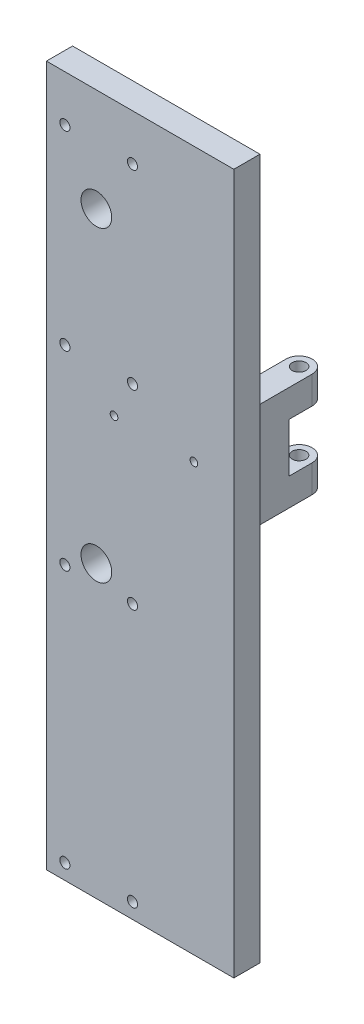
ISO-10303-21;
HEADER;
FILE_DESCRIPTION(('STEP AP214'),'2;1');
FILE_NAME('part.step','',(''),(''),'','','');
FILE_SCHEMA(('AUTOMOTIVE_DESIGN { 1 0 10303 214 1 1 1 1 }'));
ENDSEC;
DATA;
#1=APPLICATION_CONTEXT('core data for automotive mechanical design processes');
#2=APPLICATION_PROTOCOL_DEFINITION('international standard','automotive_design',2000,#1);
#3=PRODUCT_CONTEXT('',#1,'mechanical');
#4=PRODUCT('Part','Part','',(#3));
#5=PRODUCT_RELATED_PRODUCT_CATEGORY('part','',(#4));
#6=PRODUCT_DEFINITION_FORMATION('','',#4);
#7=PRODUCT_DEFINITION_CONTEXT('part definition',#1,'design');
#8=PRODUCT_DEFINITION('design','',#6,#7);
#9=PRODUCT_DEFINITION_SHAPE('','',#8);
#10=(LENGTH_UNIT() NAMED_UNIT(*) SI_UNIT(.MILLI.,.METRE.));
#11=(NAMED_UNIT(*) PLANE_ANGLE_UNIT() SI_UNIT($,.RADIAN.));
#12=(NAMED_UNIT(*) SI_UNIT($,.STERADIAN.) SOLID_ANGLE_UNIT());
#13=UNCERTAINTY_MEASURE_WITH_UNIT(LENGTH_MEASURE(1.E-05),#10,'distance_accuracy_value','');
#14=(GEOMETRIC_REPRESENTATION_CONTEXT(3) GLOBAL_UNCERTAINTY_ASSIGNED_CONTEXT((#13)) GLOBAL_UNIT_ASSIGNED_CONTEXT((#10,
#11,#12)) REPRESENTATION_CONTEXT('',''));
#15=CARTESIAN_POINT('',(0.,0.,0.));
#16=DIRECTION('',(0.,0.,1.));
#17=DIRECTION('',(1.,0.,0.));
#18=AXIS2_PLACEMENT_3D('',#15,#16,#17);
#19=CARTESIAN_POINT('',(0.,68.,0.));
#20=DIRECTION('',(0.,0.,-1.));
#21=DIRECTION('',(-1.,0.,0.));
#22=AXIS2_PLACEMENT_3D('',#19,#20,#21);
#23=PLANE('',#22);
#24=CARTESIAN_POINT('',(32.5000000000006,145.,0.));
#25=DIRECTION('',(0.,0.,-1.));
#26=DIRECTION('',(-1.,0.,0.));
#27=AXIS2_PLACEMENT_3D('',#24,#25,#26);
#28=CIRCLE('',#27,10.);
#29=CARTESIAN_POINT('',(22.5000000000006,145.,0.));
#30=VERTEX_POINT('',#29);
#31=EDGE_CURVE('E626',#30,#30,#28,.T.);
#32=ORIENTED_EDGE('',*,*,#31,.F.);
#33=EDGE_LOOP('',(#32));
#34=FACE_BOUND('',#33,.T.);
#35=CARTESIAN_POINT('',(32.5000000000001,-55.0000000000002,0.));
#36=DIRECTION('',(0.,0.,-1.));
#37=DIRECTION('',(-1.,0.,0.));
#38=AXIS2_PLACEMENT_3D('',#35,#36,#37);
#39=CIRCLE('',#38,10.);
#40=CARTESIAN_POINT('',(22.5000000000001,-55.0000000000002,0.));
#41=VERTEX_POINT('',#40);
#42=EDGE_CURVE('E636',#41,#41,#39,.T.);
#43=ORIENTED_EDGE('',*,*,#42,.F.);
#44=EDGE_LOOP('',(#43));
#45=FACE_BOUND('',#44,.T.);
#46=CARTESIAN_POINT('',(12.,58.,0.));
#47=DIRECTION('',(0.,0.,-1.));
#48=DIRECTION('',(-1.,0.,0.));
#49=AXIS2_PLACEMENT_3D('',#46,#47,#48);
#50=CIRCLE('',#49,3.29999999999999);
#51=CARTESIAN_POINT('',(8.70000000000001,58.,0.));
#52=VERTEX_POINT('',#51);
#53=EDGE_CURVE('E642',#52,#52,#50,.T.);
#54=ORIENTED_EDGE('',*,*,#53,.F.);
#55=EDGE_LOOP('',(#54));
#56=FACE_BOUND('',#55,.T.);
#57=CARTESIAN_POINT('',(56.,58.,0.));
#58=DIRECTION('',(0.,0.,-1.));
#59=DIRECTION('',(-1.,0.,0.));
#60=AXIS2_PLACEMENT_3D('',#57,#58,#59);
#61=CIRCLE('',#60,3.29999999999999);
#62=CARTESIAN_POINT('',(52.7,58.,0.));
#63=VERTEX_POINT('',#62);
#64=EDGE_CURVE('E34',#63,#63,#61,.T.);
#65=ORIENTED_EDGE('',*,*,#64,.F.);
#66=EDGE_LOOP('',(#65));
#67=FACE_BOUND('',#66,.T.);
#68=CARTESIAN_POINT('',(56.,-66.,0.));
#69=DIRECTION('',(0.,0.,-1.));
#70=DIRECTION('',(-1.,0.,0.));
#71=AXIS2_PLACEMENT_3D('',#68,#69,#70);
#72=CIRCLE('',#71,3.29999999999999);
#73=CARTESIAN_POINT('',(52.7,-66.,0.));
#74=VERTEX_POINT('',#73);
#75=EDGE_CURVE('E651',#74,#74,#72,.T.);
#76=ORIENTED_EDGE('',*,*,#75,.F.);
#77=EDGE_LOOP('',(#76));
#78=FACE_BOUND('',#77,.T.);
#79=CARTESIAN_POINT('',(12.,-66.,0.));
#80=DIRECTION('',(0.,0.,-1.));
#81=DIRECTION('',(-1.,0.,0.));
#82=AXIS2_PLACEMENT_3D('',#79,#80,#81);
#83=CIRCLE('',#82,3.29999999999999);
#84=CARTESIAN_POINT('',(8.70000000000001,-66.,0.));
#85=VERTEX_POINT('',#84);
#86=EDGE_CURVE('E657',#85,#85,#83,.T.);
#87=ORIENTED_EDGE('',*,*,#86,.F.);
#88=EDGE_LOOP('',(#87));
#89=FACE_BOUND('',#88,.T.);
#90=CARTESIAN_POINT('',(12.,-234.,0.));
#91=DIRECTION('',(0.,0.,-1.));
#92=DIRECTION('',(-1.,0.,0.));
#93=AXIS2_PLACEMENT_3D('',#90,#91,#92);
#94=CIRCLE('',#93,3.29999999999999);
#95=CARTESIAN_POINT('',(8.70000000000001,-234.,0.));
#96=VERTEX_POINT('',#95);
#97=EDGE_CURVE('E170',#96,#96,#94,.T.);
#98=ORIENTED_EDGE('',*,*,#97,.F.);
#99=EDGE_LOOP('',(#98));
#100=FACE_BOUND('',#99,.T.);
#101=CARTESIAN_POINT('',(56.,-234.,0.));
#102=DIRECTION('',(0.,0.,-1.));
#103=DIRECTION('',(-1.,0.,0.));
#104=AXIS2_PLACEMENT_3D('',#101,#102,#103);
#105=CIRCLE('',#104,3.29999999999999);
#106=CARTESIAN_POINT('',(52.7,-234.,0.));
#107=VERTEX_POINT('',#106);
#108=EDGE_CURVE('E160',#107,#107,#105,.T.);
#109=ORIENTED_EDGE('',*,*,#108,.F.);
#110=EDGE_LOOP('',(#109));
#111=FACE_BOUND('',#110,.T.);
#112=CARTESIAN_POINT('',(12.,182.,0.));
#113=DIRECTION('',(0.,0.,-1.));
#114=DIRECTION('',(-1.,0.,0.));
#115=AXIS2_PLACEMENT_3D('',#112,#113,#114);
#116=CIRCLE('',#115,3.29999999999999);
#117=CARTESIAN_POINT('',(8.70000000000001,182.,0.));
#118=VERTEX_POINT('',#117);
#119=EDGE_CURVE('E167',#118,#118,#116,.T.);
#120=ORIENTED_EDGE('',*,*,#119,.F.);
#121=EDGE_LOOP('',(#120));
#122=FACE_BOUND('',#121,.T.);
#123=CARTESIAN_POINT('',(56.,182.,0.));
#124=DIRECTION('',(0.,0.,-1.));
#125=DIRECTION('',(-1.,0.,0.));
#126=AXIS2_PLACEMENT_3D('',#123,#124,#125);
#127=CIRCLE('',#126,3.29999999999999);
#128=CARTESIAN_POINT('',(52.7,182.,0.));
#129=VERTEX_POINT('',#128);
#130=EDGE_CURVE('E148',#129,#129,#127,.T.);
#131=ORIENTED_EDGE('',*,*,#130,.F.);
#132=EDGE_LOOP('',(#131));
#133=FACE_BOUND('',#132,.T.);
#134=DIRECTION('',(0.,1.,0.));
#135=VECTOR('',#134,1.);
#136=CARTESIAN_POINT('',(122.,0.,0.));
#137=LINE('',#136,#135);
#138=CARTESIAN_POINT('',(122.,-244.,-1.11022302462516E-13));
#139=VERTEX_POINT('',#138);
#140=CARTESIAN_POINT('',(122.,212.,0.));
#141=VERTEX_POINT('',#140);
#142=EDGE_CURVE('E121',#139,#141,#137,.T.);
#143=ORIENTED_EDGE('',*,*,#142,.F.);
#144=DIRECTION('',(1.,0.,0.));
#145=VECTOR('',#144,1.);
#146=CARTESIAN_POINT('',(0.,-244.,0.));
#147=LINE('',#146,#145);
#148=CARTESIAN_POINT('',(0.,-244.,0.));
#149=VERTEX_POINT('',#148);
#150=EDGE_CURVE('E125',#149,#139,#147,.T.);
#151=ORIENTED_EDGE('',*,*,#150,.F.);
#152=DIRECTION('',(0.,-1.,0.));
#153=VECTOR('',#152,1.);
#154=CARTESIAN_POINT('',(0.,0.,0.));
#155=LINE('',#154,#153);
#156=CARTESIAN_POINT('',(0.,212.,0.));
#157=VERTEX_POINT('',#156);
#158=EDGE_CURVE('E133',#157,#149,#155,.T.);
#159=ORIENTED_EDGE('',*,*,#158,.F.);
#160=DIRECTION('',(-1.,0.,0.));
#161=VECTOR('',#160,1.);
#162=CARTESIAN_POINT('',(0.,212.,0.));
#163=LINE('',#162,#161);
#164=EDGE_CURVE('E128',#141,#157,#163,.T.);
#165=ORIENTED_EDGE('',*,*,#164,.F.);
#166=EDGE_LOOP('',(#143,#151,#159,#165));
#167=FACE_BOUND('',#166,.T.);
#168=DIRECTION('',(0.,-1.,0.));
#169=VECTOR('',#168,1.);
#170=CARTESIAN_POINT('',(119.,18.,0.));
#171=LINE('',#170,#169);
#172=CARTESIAN_POINT('',(119.,68.,0.));
#173=VERTEX_POINT('',#172);
#174=CARTESIAN_POINT('',(119.,0.,0.));
#175=VERTEX_POINT('',#174);
#176=EDGE_CURVE('E265',#173,#175,#171,.T.);
#177=ORIENTED_EDGE('',*,*,#176,.F.);
#178=DIRECTION('',(1.,0.,0.));
#179=VECTOR('',#178,1.);
#180=CARTESIAN_POINT('',(0.,68.,0.));
#181=LINE('',#180,#179);
#182=CARTESIAN_POINT('',(102.,68.,0.));
#183=VERTEX_POINT('',#182);
#184=EDGE_CURVE('E39',#183,#173,#181,.T.);
#185=ORIENTED_EDGE('',*,*,#184,.F.);
#186=DIRECTION('',(0.,-1.,0.));
#187=VECTOR('',#186,1.);
#188=CARTESIAN_POINT('',(102.,18.,0.));
#189=LINE('',#188,#187);
#190=CARTESIAN_POINT('',(102.,0.,0.));
#191=VERTEX_POINT('',#190);
#192=EDGE_CURVE('E259',#183,#191,#189,.T.);
#193=ORIENTED_EDGE('',*,*,#192,.T.);
#194=DIRECTION('',(-1.,0.,0.));
#195=VECTOR('',#194,1.);
#196=CARTESIAN_POINT('',(0.,0.,0.));
#197=LINE('',#196,#195);
#198=EDGE_CURVE('E11',#175,#191,#197,.T.);
#199=ORIENTED_EDGE('',*,*,#198,.F.);
#200=EDGE_LOOP('',(#177,#185,#193,#199));
#201=FACE_BOUND('',#200,.T.);
#202=CARTESIAN_POINT('',(44.,34.,0.));
#203=DIRECTION('',(0.,0.,1.));
#204=DIRECTION('',(1.,0.,0.));
#205=AXIS2_PLACEMENT_3D('',#202,#203,#204);
#206=CIRCLE('',#205,2.5);
#207=CARTESIAN_POINT('',(46.5,34.,0.));
#208=VERTEX_POINT('',#207);
#209=EDGE_CURVE('E270',#208,#208,#206,.T.);
#210=ORIENTED_EDGE('',*,*,#209,.T.);
#211=EDGE_LOOP('',(#210));
#212=FACE_BOUND('',#211,.T.);
#213=CARTESIAN_POINT('',(96.,34.,0.));
#214=DIRECTION('',(0.,0.,1.));
#215=DIRECTION('',(1.,0.,0.));
#216=AXIS2_PLACEMENT_3D('',#213,#214,#215);
#217=CIRCLE('',#216,2.5);
#218=CARTESIAN_POINT('',(98.5,34.,0.));
#219=VERTEX_POINT('',#218);
#220=EDGE_CURVE('E708',#219,#219,#217,.T.);
#221=ORIENTED_EDGE('',*,*,#220,.T.);
#222=EDGE_LOOP('',(#221));
#223=FACE_BOUND('',#222,.T.);
#224=ADVANCED_FACE('F30',(#34,#45,#56,#67,#78,#89,#100,#111,#122,#133,#167,#201,#212,#223),#23,.T.);
#225=CARTESIAN_POINT('',(0.,0.,17.));
#226=DIRECTION('',(1.,0.,0.));
#227=DIRECTION('',(0.,0.,-1.));
#228=AXIS2_PLACEMENT_3D('',#225,#226,#227);
#229=PLANE('',#228);
#230=ORIENTED_EDGE('',*,*,#158,.T.);
#231=DIRECTION('',(0.,0.,1.));
#232=VECTOR('',#231,1.);
#233=CARTESIAN_POINT('',(0.,-244.,-272.800293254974));
#234=LINE('',#233,#232);
#235=CARTESIAN_POINT('',(0.,-244.,17.));
#236=VERTEX_POINT('',#235);
#237=EDGE_CURVE('E142',#149,#236,#234,.T.);
#238=ORIENTED_EDGE('',*,*,#237,.T.);
#239=DIRECTION('',(0.,-1.,0.));
#240=VECTOR('',#239,1.);
#241=CARTESIAN_POINT('',(0.,0.,17.));
#242=LINE('',#241,#240);
#243=CARTESIAN_POINT('',(0.,212.,17.));
#244=VERTEX_POINT('',#243);
#245=EDGE_CURVE('E132',#244,#236,#242,.T.);
#246=ORIENTED_EDGE('',*,*,#245,.F.);
#247=DIRECTION('',(0.,0.,1.));
#248=VECTOR('',#247,1.);
#249=CARTESIAN_POINT('',(0.,212.,-272.800293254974));
#250=LINE('',#249,#248);
#251=EDGE_CURVE('E211',#157,#244,#250,.T.);
#252=ORIENTED_EDGE('',*,*,#251,.F.);
#253=EDGE_LOOP('',(#230,#238,#246,#252));
#254=FACE_BOUND('',#253,.T.);
#255=ADVANCED_FACE('F32',(#254),#229,.F.);
#256=CARTESIAN_POINT('',(0.,0.,17.));
#257=DIRECTION('',(0.,1.,0.));
#258=DIRECTION('',(0.,0.,1.));
#259=AXIS2_PLACEMENT_3D('',#256,#257,#258);
#260=PLANE('',#259);
#261=DIRECTION('',(0.,0.,1.));
#262=VECTOR('',#261,1.);
#263=CARTESIAN_POINT('',(119.,0.,0.));
#264=LINE('',#263,#262);
#265=CARTESIAN_POINT('',(119.,0.,-37.));
#266=VERTEX_POINT('',#265);
#267=EDGE_CURVE('E254',#266,#175,#264,.T.);
#268=ORIENTED_EDGE('',*,*,#267,.T.);
#269=ORIENTED_EDGE('',*,*,#198,.T.);
#270=DIRECTION('',(0.,0.,-1.));
#271=VECTOR('',#270,1.);
#272=CARTESIAN_POINT('',(102.,0.,0.));
#273=LINE('',#272,#271);
#274=CARTESIAN_POINT('',(102.,0.,-37.));
#275=VERTEX_POINT('',#274);
#276=EDGE_CURVE('E249',#191,#275,#273,.T.);
#277=ORIENTED_EDGE('',*,*,#276,.T.);
#278=CARTESIAN_POINT('',(110.5,0.,-37.));
#279=DIRECTION('',(0.,-1.,0.));
#280=DIRECTION('',(0.,0.,1.));
#281=AXIS2_PLACEMENT_3D('',#278,#279,#280);
#282=CIRCLE('',#281,8.49999999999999);
#283=EDGE_CURVE('E260',#275,#266,#282,.T.);
#284=ORIENTED_EDGE('',*,*,#283,.T.);
#285=EDGE_LOOP('',(#268,#269,#277,#284));
#286=FACE_BOUND('',#285,.T.);
#287=CARTESIAN_POINT('',(110.5,0.,-37.));
#288=DIRECTION('',(0.,-1.,0.));
#289=DIRECTION('',(0.,0.,-1.));
#290=AXIS2_PLACEMENT_3D('',#287,#288,#289);
#291=CIRCLE('',#290,4.50000000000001);
#292=CARTESIAN_POINT('',(110.5,0.,-41.5));
#293=VERTEX_POINT('',#292);
#294=EDGE_CURVE('E243',#293,#293,#291,.T.);
#295=ORIENTED_EDGE('',*,*,#294,.F.);
#296=EDGE_LOOP('',(#295));
#297=FACE_BOUND('',#296,.T.);
#298=ADVANCED_FACE('F314',(#286,#297),#260,.F.);
#299=CARTESIAN_POINT('',(122.,0.,17.));
#300=DIRECTION('',(-1.,0.,0.));
#301=DIRECTION('',(0.,0.,1.));
#302=AXIS2_PLACEMENT_3D('',#299,#300,#301);
#303=PLANE('',#302);
#304=ORIENTED_EDGE('',*,*,#142,.T.);
#305=DIRECTION('',(0.,0.,1.));
#306=VECTOR('',#305,1.);
#307=CARTESIAN_POINT('',(122.,212.,-272.800293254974));
#308=LINE('',#307,#306);
#309=CARTESIAN_POINT('',(122.,212.,17.));
#310=VERTEX_POINT('',#309);
#311=EDGE_CURVE('E207',#141,#310,#308,.T.);
#312=ORIENTED_EDGE('',*,*,#311,.T.);
#313=DIRECTION('',(0.,1.,0.));
#314=VECTOR('',#313,1.);
#315=CARTESIAN_POINT('',(122.,0.,17.));
#316=LINE('',#315,#314);
#317=CARTESIAN_POINT('',(122.,-244.,17.));
#318=VERTEX_POINT('',#317);
#319=EDGE_CURVE('E138',#318,#310,#316,.T.);
#320=ORIENTED_EDGE('',*,*,#319,.F.);
#321=DIRECTION('',(0.,0.,1.));
#322=VECTOR('',#321,1.);
#323=CARTESIAN_POINT('',(122.,-244.,-272.800293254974));
#324=LINE('',#323,#322);
#325=EDGE_CURVE('E136',#139,#318,#324,.T.);
#326=ORIENTED_EDGE('',*,*,#325,.F.);
#327=EDGE_LOOP('',(#304,#312,#320,#326));
#328=FACE_BOUND('',#327,.T.);
#329=ADVANCED_FACE('F137',(#328),#303,.F.);
#330=CARTESIAN_POINT('',(0.,68.,17.));
#331=DIRECTION('',(0.,-1.,0.));
#332=DIRECTION('',(0.,0.,-1.));
#333=AXIS2_PLACEMENT_3D('',#330,#331,#332);
#334=PLANE('',#333);
#335=DIRECTION('',(0.,0.,-1.));
#336=VECTOR('',#335,1.);
#337=CARTESIAN_POINT('',(102.,68.,0.));
#338=LINE('',#337,#336);
#339=CARTESIAN_POINT('',(102.,68.,-37.));
#340=VERTEX_POINT('',#339);
#341=EDGE_CURVE('E233',#183,#340,#338,.T.);
#342=ORIENTED_EDGE('',*,*,#341,.F.);
#343=ORIENTED_EDGE('',*,*,#184,.T.);
#344=DIRECTION('',(0.,0.,1.));
#345=VECTOR('',#344,1.);
#346=CARTESIAN_POINT('',(119.,68.,0.));
#347=LINE('',#346,#345);
#348=CARTESIAN_POINT('',(119.,68.,-37.));
#349=VERTEX_POINT('',#348);
#350=EDGE_CURVE('E227',#349,#173,#347,.T.);
#351=ORIENTED_EDGE('',*,*,#350,.F.);
#352=CARTESIAN_POINT('',(110.5,68.,-37.));
#353=DIRECTION('',(0.,-1.,0.));
#354=DIRECTION('',(0.,0.,1.));
#355=AXIS2_PLACEMENT_3D('',#352,#353,#354);
#356=CIRCLE('',#355,8.49999999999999);
#357=EDGE_CURVE('E238',#340,#349,#356,.T.);
#358=ORIENTED_EDGE('',*,*,#357,.F.);
#359=EDGE_LOOP('',(#342,#343,#351,#358));
#360=FACE_BOUND('',#359,.T.);
#361=CARTESIAN_POINT('',(110.5,68.,-37.));
#362=DIRECTION('',(0.,-1.,0.));
#363=DIRECTION('',(0.,0.,-1.));
#364=AXIS2_PLACEMENT_3D('',#361,#362,#363);
#365=CIRCLE('',#364,4.50000000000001);
#366=CARTESIAN_POINT('',(110.5,68.,-41.5));
#367=VERTEX_POINT('',#366);
#368=EDGE_CURVE('E217',#367,#367,#365,.T.);
#369=ORIENTED_EDGE('',*,*,#368,.T.);
#370=EDGE_LOOP('',(#369));
#371=FACE_BOUND('',#370,.T.);
#372=ADVANCED_FACE('F189',(#360,#371),#334,.F.);
#373=CARTESIAN_POINT('',(0.,68.,17.));
#374=DIRECTION('',(0.,0.,-1.));
#375=DIRECTION('',(-1.,0.,0.));
#376=AXIS2_PLACEMENT_3D('',#373,#374,#375);
#377=PLANE('',#376);
#378=CARTESIAN_POINT('',(32.5000000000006,145.,17.));
#379=DIRECTION('',(0.,0.,1.));
#380=DIRECTION('',(1.,0.,0.));
#381=AXIS2_PLACEMENT_3D('',#378,#379,#380);
#382=CIRCLE('',#381,10.);
#383=CARTESIAN_POINT('',(42.5000000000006,145.,17.));
#384=VERTEX_POINT('',#383);
#385=EDGE_CURVE('E629',#384,#384,#382,.T.);
#386=ORIENTED_EDGE('',*,*,#385,.F.);
#387=EDGE_LOOP('',(#386));
#388=FACE_BOUND('',#387,.T.);
#389=CARTESIAN_POINT('',(32.5000000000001,-55.0000000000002,17.));
#390=DIRECTION('',(0.,0.,1.));
#391=DIRECTION('',(1.,0.,0.));
#392=AXIS2_PLACEMENT_3D('',#389,#390,#391);
#393=CIRCLE('',#392,10.);
#394=CARTESIAN_POINT('',(42.5000000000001,-55.0000000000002,17.));
#395=VERTEX_POINT('',#394);
#396=EDGE_CURVE('E631',#395,#395,#393,.T.);
#397=ORIENTED_EDGE('',*,*,#396,.F.);
#398=EDGE_LOOP('',(#397));
#399=FACE_BOUND('',#398,.T.);
#400=CARTESIAN_POINT('',(12.,58.,17.));
#401=DIRECTION('',(0.,0.,1.));
#402=DIRECTION('',(1.,0.,0.));
#403=AXIS2_PLACEMENT_3D('',#400,#401,#402);
#404=CIRCLE('',#403,3.29999999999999);
#405=CARTESIAN_POINT('',(15.3,58.,17.));
#406=VERTEX_POINT('',#405);
#407=EDGE_CURVE('E639',#406,#406,#404,.T.);
#408=ORIENTED_EDGE('',*,*,#407,.F.);
#409=EDGE_LOOP('',(#408));
#410=FACE_BOUND('',#409,.T.);
#411=CARTESIAN_POINT('',(56.,58.,17.));
#412=DIRECTION('',(0.,0.,1.));
#413=DIRECTION('',(1.,0.,0.));
#414=AXIS2_PLACEMENT_3D('',#411,#412,#413);
#415=CIRCLE('',#414,3.29999999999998);
#416=CARTESIAN_POINT('',(59.3,58.,17.));
#417=VERTEX_POINT('',#416);
#418=EDGE_CURVE('E645',#417,#417,#415,.T.);
#419=ORIENTED_EDGE('',*,*,#418,.F.);
#420=EDGE_LOOP('',(#419));
#421=FACE_BOUND('',#420,.T.);
#422=CARTESIAN_POINT('',(56.,-66.,17.));
#423=DIRECTION('',(0.,0.,1.));
#424=DIRECTION('',(1.,0.,0.));
#425=AXIS2_PLACEMENT_3D('',#422,#423,#424);
#426=CIRCLE('',#425,3.29999999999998);
#427=CARTESIAN_POINT('',(59.3,-66.,17.));
#428=VERTEX_POINT('',#427);
#429=EDGE_CURVE('E648',#428,#428,#426,.T.);
#430=ORIENTED_EDGE('',*,*,#429,.F.);
#431=EDGE_LOOP('',(#430));
#432=FACE_BOUND('',#431,.T.);
#433=CARTESIAN_POINT('',(12.,-66.,17.));
#434=DIRECTION('',(0.,0.,1.));
#435=DIRECTION('',(1.,0.,0.));
#436=AXIS2_PLACEMENT_3D('',#433,#434,#435);
#437=CIRCLE('',#436,3.29999999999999);
#438=CARTESIAN_POINT('',(15.3,-66.,17.));
#439=VERTEX_POINT('',#438);
#440=EDGE_CURVE('E654',#439,#439,#437,.T.);
#441=ORIENTED_EDGE('',*,*,#440,.F.);
#442=EDGE_LOOP('',(#441));
#443=FACE_BOUND('',#442,.T.);
#444=CARTESIAN_POINT('',(12.,-234.,17.));
#445=DIRECTION('',(0.,0.,1.));
#446=DIRECTION('',(1.,0.,0.));
#447=AXIS2_PLACEMENT_3D('',#444,#445,#446);
#448=CIRCLE('',#447,3.29999999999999);
#449=CARTESIAN_POINT('',(15.3,-234.,17.));
#450=VERTEX_POINT('',#449);
#451=EDGE_CURVE('E175',#450,#450,#448,.T.);
#452=ORIENTED_EDGE('',*,*,#451,.F.);
#453=EDGE_LOOP('',(#452));
#454=FACE_BOUND('',#453,.T.);
#455=CARTESIAN_POINT('',(56.,-234.,17.));
#456=DIRECTION('',(0.,0.,1.));
#457=DIRECTION('',(1.,0.,0.));
#458=AXIS2_PLACEMENT_3D('',#455,#456,#457);
#459=CIRCLE('',#458,3.29999999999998);
#460=CARTESIAN_POINT('',(59.3,-234.,17.));
#461=VERTEX_POINT('',#460);
#462=EDGE_CURVE('E163',#461,#461,#459,.T.);
#463=ORIENTED_EDGE('',*,*,#462,.F.);
#464=EDGE_LOOP('',(#463));
#465=FACE_BOUND('',#464,.T.);
#466=CARTESIAN_POINT('',(12.,182.,17.));
#467=DIRECTION('',(0.,0.,1.));
#468=DIRECTION('',(1.,0.,0.));
#469=AXIS2_PLACEMENT_3D('',#466,#467,#468);
#470=CIRCLE('',#469,3.29999999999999);
#471=CARTESIAN_POINT('',(15.3,182.,17.));
#472=VERTEX_POINT('',#471);
#473=EDGE_CURVE('E162',#472,#472,#470,.T.);
#474=ORIENTED_EDGE('',*,*,#473,.F.);
#475=EDGE_LOOP('',(#474));
#476=FACE_BOUND('',#475,.T.);
#477=CARTESIAN_POINT('',(56.,182.,17.));
#478=DIRECTION('',(0.,0.,1.));
#479=DIRECTION('',(1.,0.,0.));
#480=AXIS2_PLACEMENT_3D('',#477,#478,#479);
#481=CIRCLE('',#480,3.29999999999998);
#482=CARTESIAN_POINT('',(59.3,182.,17.));
#483=VERTEX_POINT('',#482);
#484=EDGE_CURVE('E159',#483,#483,#481,.T.);
#485=ORIENTED_EDGE('',*,*,#484,.F.);
#486=EDGE_LOOP('',(#485));
#487=FACE_BOUND('',#486,.T.);
#488=CARTESIAN_POINT('',(44.,34.,17.));
#489=DIRECTION('',(0.,0.,1.));
#490=DIRECTION('',(1.,0.,0.));
#491=AXIS2_PLACEMENT_3D('',#488,#489,#490);
#492=CIRCLE('',#491,2.49999999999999);
#493=CARTESIAN_POINT('',(46.5,34.,17.));
#494=VERTEX_POINT('',#493);
#495=EDGE_CURVE('E195',#494,#494,#492,.T.);
#496=ORIENTED_EDGE('',*,*,#495,.F.);
#497=EDGE_LOOP('',(#496));
#498=FACE_BOUND('',#497,.T.);
#499=CARTESIAN_POINT('',(96.,34.,17.));
#500=DIRECTION('',(0.,0.,1.));
#501=DIRECTION('',(1.,0.,0.));
#502=AXIS2_PLACEMENT_3D('',#499,#500,#501);
#503=CIRCLE('',#502,2.49999999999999);
#504=CARTESIAN_POINT('',(98.5,34.,17.));
#505=VERTEX_POINT('',#504);
#506=EDGE_CURVE('E199',#505,#505,#503,.T.);
#507=ORIENTED_EDGE('',*,*,#506,.F.);
#508=EDGE_LOOP('',(#507));
#509=FACE_BOUND('',#508,.T.);
#510=ORIENTED_EDGE('',*,*,#245,.T.);
#511=DIRECTION('',(1.,0.,0.));
#512=VECTOR('',#511,1.);
#513=CARTESIAN_POINT('',(0.,-244.,17.));
#514=LINE('',#513,#512);
#515=EDGE_CURVE('E146',#236,#318,#514,.T.);
#516=ORIENTED_EDGE('',*,*,#515,.T.);
#517=ORIENTED_EDGE('',*,*,#319,.T.);
#518=DIRECTION('',(-1.,0.,0.));
#519=VECTOR('',#518,1.);
#520=CARTESIAN_POINT('',(0.,212.,17.));
#521=LINE('',#520,#519);
#522=EDGE_CURVE('E202',#310,#244,#521,.T.);
#523=ORIENTED_EDGE('',*,*,#522,.T.);
#524=EDGE_LOOP('',(#510,#516,#517,#523));
#525=FACE_BOUND('',#524,.T.);
#526=ADVANCED_FACE('F185',(#388,#399,#410,#421,#432,#443,#454,#465,#476,#487,#498,#509,#525),
#377,.F.);
#527=CARTESIAN_POINT('',(96.,34.,17.));
#528=DIRECTION('',(0.,0.,1.));
#529=DIRECTION('',(1.,0.,0.));
#530=AXIS2_PLACEMENT_3D('',#527,#528,#529);
#531=CYLINDRICAL_SURFACE('',#530,2.5);
#532=ORIENTED_EDGE('',*,*,#220,.F.);
#533=EDGE_LOOP('',(#532));
#534=FACE_BOUND('',#533,.T.);
#535=ORIENTED_EDGE('',*,*,#506,.T.);
#536=EDGE_LOOP('',(#535));
#537=FACE_BOUND('',#536,.T.);
#538=ADVANCED_FACE('F188',(#534,#537),#531,.F.);
#539=CARTESIAN_POINT('',(44.,34.,17.));
#540=DIRECTION('',(0.,0.,1.));
#541=DIRECTION('',(1.,0.,0.));
#542=AXIS2_PLACEMENT_3D('',#539,#540,#541);
#543=CYLINDRICAL_SURFACE('',#542,2.49999999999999);
#544=ORIENTED_EDGE('',*,*,#209,.F.);
#545=EDGE_LOOP('',(#544));
#546=FACE_BOUND('',#545,.T.);
#547=ORIENTED_EDGE('',*,*,#495,.T.);
#548=EDGE_LOOP('',(#547));
#549=FACE_BOUND('',#548,.T.);
#550=ADVANCED_FACE('F365',(#546,#549),#543,.F.);
#551=CARTESIAN_POINT('',(119.,18.,0.));
#552=DIRECTION('',(1.,0.,0.));
#553=DIRECTION('',(0.,0.,-1.));
#554=AXIS2_PLACEMENT_3D('',#551,#552,#553);
#555=PLANE('',#554);
#556=ORIENTED_EDGE('',*,*,#267,.F.);
#557=DIRECTION('',(0.,-1.,0.));
#558=VECTOR('',#557,1.);
#559=CARTESIAN_POINT('',(119.,18.,-37.));
#560=LINE('',#559,#558);
#561=CARTESIAN_POINT('',(119.,18.,-37.));
#562=VERTEX_POINT('',#561);
#563=EDGE_CURVE('E263',#562,#266,#560,.T.);
#564=ORIENTED_EDGE('',*,*,#563,.F.);
#565=DIRECTION('',(0.,0.,1.));
#566=VECTOR('',#565,1.);
#567=CARTESIAN_POINT('',(119.,18.,0.));
#568=LINE('',#567,#566);
#569=CARTESIAN_POINT('',(119.,18.,-22.));
#570=VERTEX_POINT('',#569);
#571=EDGE_CURVE('E257',#562,#570,#568,.T.);
#572=ORIENTED_EDGE('',*,*,#571,.T.);
#573=DIRECTION('',(0.,1.,0.));
#574=VECTOR('',#573,1.);
#575=CARTESIAN_POINT('',(119.,50.,-22.));
#576=LINE('',#575,#574);
#577=CARTESIAN_POINT('',(119.,50.,-22.));
#578=VERTEX_POINT('',#577);
#579=EDGE_CURVE('E213',#570,#578,#576,.T.);
#580=ORIENTED_EDGE('',*,*,#579,.T.);
#581=DIRECTION('',(0.,0.,1.));
#582=VECTOR('',#581,1.);
#583=CARTESIAN_POINT('',(119.,50.,0.));
#584=LINE('',#583,#582);
#585=CARTESIAN_POINT('',(119.,50.,-37.));
#586=VERTEX_POINT('',#585);
#587=EDGE_CURVE('E230',#586,#578,#584,.T.);
#588=ORIENTED_EDGE('',*,*,#587,.F.);
#589=DIRECTION('',(0.,1.,0.));
#590=VECTOR('',#589,1.);
#591=CARTESIAN_POINT('',(119.,50.,-37.));
#592=LINE('',#591,#590);
#593=EDGE_CURVE('E237',#586,#349,#592,.T.);
#594=ORIENTED_EDGE('',*,*,#593,.T.);
#595=ORIENTED_EDGE('',*,*,#350,.T.);
#596=ORIENTED_EDGE('',*,*,#176,.T.);
#597=EDGE_LOOP('',(#556,#564,#572,#580,#588,#594,#595,#596));
#598=FACE_BOUND('',#597,.T.);
#599=ADVANCED_FACE('F308',(#598),#555,.T.);
#600=CARTESIAN_POINT('',(110.5,18.,-37.));
#601=DIRECTION('',(0.,-1.,0.));
#602=DIRECTION('',(0.,0.,-1.));
#603=AXIS2_PLACEMENT_3D('',#600,#601,#602);
#604=CYLINDRICAL_SURFACE('',#603,8.49999999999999);
#605=ORIENTED_EDGE('',*,*,#283,.F.);
#606=DIRECTION('',(0.,-1.,0.));
#607=VECTOR('',#606,1.);
#608=CARTESIAN_POINT('',(102.,18.,-37.));
#609=LINE('',#608,#607);
#610=CARTESIAN_POINT('',(102.,18.,-37.));
#611=VERTEX_POINT('',#610);
#612=EDGE_CURVE('E266',#611,#275,#609,.T.);
#613=ORIENTED_EDGE('',*,*,#612,.F.);
#614=CARTESIAN_POINT('',(110.5,18.,-37.));
#615=DIRECTION('',(0.,-1.,0.));
#616=DIRECTION('',(0.,0.,1.));
#617=AXIS2_PLACEMENT_3D('',#614,#615,#616);
#618=CIRCLE('',#617,8.49999999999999);
#619=EDGE_CURVE('E253',#611,#562,#618,.T.);
#620=ORIENTED_EDGE('',*,*,#619,.T.);
#621=ORIENTED_EDGE('',*,*,#563,.T.);
#622=EDGE_LOOP('',(#605,#613,#620,#621));
#623=FACE_BOUND('',#622,.T.);
#624=ADVANCED_FACE('F320',(#623),#604,.T.);
#625=CARTESIAN_POINT('',(102.,18.,0.));
#626=DIRECTION('',(-1.,0.,0.));
#627=DIRECTION('',(0.,0.,1.));
#628=AXIS2_PLACEMENT_3D('',#625,#626,#627);
#629=PLANE('',#628);
#630=ORIENTED_EDGE('',*,*,#276,.F.);
#631=ORIENTED_EDGE('',*,*,#192,.F.);
#632=ORIENTED_EDGE('',*,*,#341,.T.);
#633=DIRECTION('',(0.,1.,0.));
#634=VECTOR('',#633,1.);
#635=CARTESIAN_POINT('',(102.,50.,-37.));
#636=LINE('',#635,#634);
#637=CARTESIAN_POINT('',(102.,50.,-37.));
#638=VERTEX_POINT('',#637);
#639=EDGE_CURVE('E240',#638,#340,#636,.T.);
#640=ORIENTED_EDGE('',*,*,#639,.F.);
#641=DIRECTION('',(0.,0.,-1.));
#642=VECTOR('',#641,1.);
#643=CARTESIAN_POINT('',(102.,50.,0.));
#644=LINE('',#643,#642);
#645=CARTESIAN_POINT('',(102.,50.,-22.));
#646=VERTEX_POINT('',#645);
#647=EDGE_CURVE('E235',#646,#638,#644,.T.);
#648=ORIENTED_EDGE('',*,*,#647,.F.);
#649=DIRECTION('',(0.,-1.,0.));
#650=VECTOR('',#649,1.);
#651=CARTESIAN_POINT('',(102.,50.,-22.));
#652=LINE('',#651,#650);
#653=CARTESIAN_POINT('',(102.,18.,-22.));
#654=VERTEX_POINT('',#653);
#655=EDGE_CURVE('E215',#646,#654,#652,.T.);
#656=ORIENTED_EDGE('',*,*,#655,.T.);
#657=DIRECTION('',(0.,0.,-1.));
#658=VECTOR('',#657,1.);
#659=CARTESIAN_POINT('',(102.,18.,0.));
#660=LINE('',#659,#658);
#661=EDGE_CURVE('E47',#654,#611,#660,.T.);
#662=ORIENTED_EDGE('',*,*,#661,.T.);
#663=ORIENTED_EDGE('',*,*,#612,.T.);
#664=EDGE_LOOP('',(#630,#631,#632,#640,#648,#656,#662,#663));
#665=FACE_BOUND('',#664,.T.);
#666=ADVANCED_FACE('F294',(#665),#629,.T.);
#667=CARTESIAN_POINT('',(110.5,18.,-37.));
#668=DIRECTION('',(0.,1.,0.));
#669=DIRECTION('',(0.,0.,1.));
#670=AXIS2_PLACEMENT_3D('',#667,#668,#669);
#671=PLANE('',#670);
#672=DIRECTION('',(1.,0.,0.));
#673=VECTOR('',#672,1.);
#674=CARTESIAN_POINT('',(63.1670243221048,18.,-22.));
#675=LINE('',#674,#673);
#676=EDGE_CURVE('E52',#654,#570,#675,.T.);
#677=ORIENTED_EDGE('',*,*,#676,.T.);
#678=ORIENTED_EDGE('',*,*,#571,.F.);
#679=ORIENTED_EDGE('',*,*,#619,.F.);
#680=ORIENTED_EDGE('',*,*,#661,.F.);
#681=EDGE_LOOP('',(#677,#678,#679,#680));
#682=FACE_BOUND('',#681,.T.);
#683=CARTESIAN_POINT('',(110.5,18.,-37.));
#684=DIRECTION('',(0.,-1.,0.));
#685=DIRECTION('',(0.,0.,-1.));
#686=AXIS2_PLACEMENT_3D('',#683,#684,#685);
#687=CIRCLE('',#686,4.50000000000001);
#688=CARTESIAN_POINT('',(110.5,18.,-41.5));
#689=VERTEX_POINT('',#688);
#690=EDGE_CURVE('E246',#689,#689,#687,.T.);
#691=ORIENTED_EDGE('',*,*,#690,.T.);
#692=EDGE_LOOP('',(#691));
#693=FACE_BOUND('',#692,.T.);
#694=ADVANCED_FACE('F321',(#682,#693),#671,.T.);
#695=CARTESIAN_POINT('',(110.5,18.,-37.));
#696=DIRECTION('',(0.,-1.,0.));
#697=DIRECTION('',(0.,0.,-1.));
#698=AXIS2_PLACEMENT_3D('',#695,#696,#697);
#699=CYLINDRICAL_SURFACE('',#698,4.50000000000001);
#700=ORIENTED_EDGE('',*,*,#690,.F.);
#701=EDGE_LOOP('',(#700));
#702=FACE_BOUND('',#701,.T.);
#703=ORIENTED_EDGE('',*,*,#294,.T.);
#704=EDGE_LOOP('',(#703));
#705=FACE_BOUND('',#704,.T.);
#706=ADVANCED_FACE('F324',(#702,#705),#699,.F.);
#707=CARTESIAN_POINT('',(110.5,50.,-37.));
#708=DIRECTION('',(0.,-1.,0.));
#709=DIRECTION('',(0.,0.,1.));
#710=AXIS2_PLACEMENT_3D('',#707,#708,#709);
#711=PLANE('',#710);
#712=DIRECTION('',(1.,0.,0.));
#713=VECTOR('',#712,1.);
#714=CARTESIAN_POINT('',(63.1670243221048,50.,-22.));
#715=LINE('',#714,#713);
#716=EDGE_CURVE('E218',#646,#578,#715,.T.);
#717=ORIENTED_EDGE('',*,*,#716,.F.);
#718=ORIENTED_EDGE('',*,*,#647,.T.);
#719=CARTESIAN_POINT('',(110.5,50.,-37.));
#720=DIRECTION('',(0.,-1.,0.));
#721=DIRECTION('',(0.,0.,1.));
#722=AXIS2_PLACEMENT_3D('',#719,#720,#721);
#723=CIRCLE('',#722,8.49999999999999);
#724=EDGE_CURVE('E232',#638,#586,#723,.T.);
#725=ORIENTED_EDGE('',*,*,#724,.T.);
#726=ORIENTED_EDGE('',*,*,#587,.T.);
#727=EDGE_LOOP('',(#717,#718,#725,#726));
#728=FACE_BOUND('',#727,.T.);
#729=CARTESIAN_POINT('',(110.5,50.,-37.));
#730=DIRECTION('',(0.,-1.,0.));
#731=DIRECTION('',(0.,0.,-1.));
#732=AXIS2_PLACEMENT_3D('',#729,#730,#731);
#733=CIRCLE('',#732,4.50000000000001);
#734=CARTESIAN_POINT('',(110.5,50.,-41.5));
#735=VERTEX_POINT('',#734);
#736=EDGE_CURVE('E224',#735,#735,#733,.T.);
#737=ORIENTED_EDGE('',*,*,#736,.F.);
#738=EDGE_LOOP('',(#737));
#739=FACE_BOUND('',#738,.T.);
#740=ADVANCED_FACE('F330',(#728,#739),#711,.T.);
#741=CARTESIAN_POINT('',(110.5,50.,-37.));
#742=DIRECTION('',(0.,1.,0.));
#743=DIRECTION('',(0.,0.,1.));
#744=AXIS2_PLACEMENT_3D('',#741,#742,#743);
#745=CYLINDRICAL_SURFACE('',#744,8.49999999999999);
#746=ORIENTED_EDGE('',*,*,#357,.T.);
#747=ORIENTED_EDGE('',*,*,#593,.F.);
#748=ORIENTED_EDGE('',*,*,#724,.F.);
#749=ORIENTED_EDGE('',*,*,#639,.T.);
#750=EDGE_LOOP('',(#746,#747,#748,#749));
#751=FACE_BOUND('',#750,.T.);
#752=ADVANCED_FACE('F301',(#751),#745,.T.);
#753=CARTESIAN_POINT('',(110.5,50.,-37.));
#754=DIRECTION('',(0.,1.,0.));
#755=DIRECTION('',(0.,0.,1.));
#756=AXIS2_PLACEMENT_3D('',#753,#754,#755);
#757=CYLINDRICAL_SURFACE('',#756,4.50000000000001);
#758=ORIENTED_EDGE('',*,*,#736,.T.);
#759=EDGE_LOOP('',(#758));
#760=FACE_BOUND('',#759,.T.);
#761=ORIENTED_EDGE('',*,*,#368,.F.);
#762=EDGE_LOOP('',(#761));
#763=FACE_BOUND('',#762,.T.);
#764=ADVANCED_FACE('F414',(#760,#763),#757,.F.);
#765=CARTESIAN_POINT('',(63.1670243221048,50.,-22.));
#766=DIRECTION('',(0.,0.,-1.));
#767=DIRECTION('',(-1.,0.,0.));
#768=AXIS2_PLACEMENT_3D('',#765,#766,#767);
#769=PLANE('',#768);
#770=ORIENTED_EDGE('',*,*,#655,.F.);
#771=ORIENTED_EDGE('',*,*,#716,.T.);
#772=ORIENTED_EDGE('',*,*,#579,.F.);
#773=ORIENTED_EDGE('',*,*,#676,.F.);
#774=EDGE_LOOP('',(#770,#771,#772,#773));
#775=FACE_BOUND('',#774,.T.);
#776=ADVANCED_FACE('F420',(#775),#769,.T.);
#777=CARTESIAN_POINT('',(0.,212.,-272.800293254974));
#778=DIRECTION('',(0.,1.,0.));
#779=DIRECTION('',(0.,0.,1.));
#780=AXIS2_PLACEMENT_3D('',#777,#778,#779);
#781=PLANE('',#780);
#782=ORIENTED_EDGE('',*,*,#311,.F.);
#783=ORIENTED_EDGE('',*,*,#164,.T.);
#784=ORIENTED_EDGE('',*,*,#251,.T.);
#785=ORIENTED_EDGE('',*,*,#522,.F.);
#786=EDGE_LOOP('',(#782,#783,#784,#785));
#787=FACE_BOUND('',#786,.T.);
#788=ADVANCED_FACE('F427',(#787),#781,.T.);
#789=CARTESIAN_POINT('',(0.,-244.,-272.800293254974));
#790=DIRECTION('',(0.,-1.,0.));
#791=DIRECTION('',(0.,0.,-1.));
#792=AXIS2_PLACEMENT_3D('',#789,#790,#791);
#793=PLANE('',#792);
#794=ORIENTED_EDGE('',*,*,#237,.F.);
#795=ORIENTED_EDGE('',*,*,#150,.T.);
#796=ORIENTED_EDGE('',*,*,#325,.T.);
#797=ORIENTED_EDGE('',*,*,#515,.F.);
#798=EDGE_LOOP('',(#794,#795,#796,#797));
#799=FACE_BOUND('',#798,.T.);
#800=ADVANCED_FACE('F144',(#799),#793,.T.);
#801=CARTESIAN_POINT('',(56.,182.,17.));
#802=DIRECTION('',(0.,0.,1.));
#803=DIRECTION('',(1.,0.,0.));
#804=AXIS2_PLACEMENT_3D('',#801,#802,#803);
#805=CYLINDRICAL_SURFACE('',#804,3.29999999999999);
#806=ORIENTED_EDGE('',*,*,#130,.T.);
#807=EDGE_LOOP('',(#806));
#808=FACE_BOUND('',#807,.T.);
#809=ORIENTED_EDGE('',*,*,#484,.T.);
#810=EDGE_LOOP('',(#809));
#811=FACE_BOUND('',#810,.T.);
#812=ADVANCED_FACE('F183',(#808,#811),#805,.F.);
#813=CARTESIAN_POINT('',(12.,182.,17.));
#814=DIRECTION('',(0.,0.,1.));
#815=DIRECTION('',(1.,0.,0.));
#816=AXIS2_PLACEMENT_3D('',#813,#814,#815);
#817=CYLINDRICAL_SURFACE('',#816,3.29999999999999);
#818=ORIENTED_EDGE('',*,*,#119,.T.);
#819=EDGE_LOOP('',(#818));
#820=FACE_BOUND('',#819,.T.);
#821=ORIENTED_EDGE('',*,*,#473,.T.);
#822=EDGE_LOOP('',(#821));
#823=FACE_BOUND('',#822,.T.);
#824=ADVANCED_FACE('F448',(#820,#823),#817,.F.);
#825=CARTESIAN_POINT('',(56.,-234.,17.));
#826=DIRECTION('',(0.,0.,1.));
#827=DIRECTION('',(1.,0.,0.));
#828=AXIS2_PLACEMENT_3D('',#825,#826,#827);
#829=CYLINDRICAL_SURFACE('',#828,3.29999999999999);
#830=ORIENTED_EDGE('',*,*,#108,.T.);
#831=EDGE_LOOP('',(#830));
#832=FACE_BOUND('',#831,.T.);
#833=ORIENTED_EDGE('',*,*,#462,.T.);
#834=EDGE_LOOP('',(#833));
#835=FACE_BOUND('',#834,.T.);
#836=ADVANCED_FACE('F456',(#832,#835),#829,.F.);
#837=CARTESIAN_POINT('',(12.,-234.,17.));
#838=DIRECTION('',(0.,0.,1.));
#839=DIRECTION('',(1.,0.,0.));
#840=AXIS2_PLACEMENT_3D('',#837,#838,#839);
#841=CYLINDRICAL_SURFACE('',#840,3.29999999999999);
#842=ORIENTED_EDGE('',*,*,#97,.T.);
#843=EDGE_LOOP('',(#842));
#844=FACE_BOUND('',#843,.T.);
#845=ORIENTED_EDGE('',*,*,#451,.T.);
#846=EDGE_LOOP('',(#845));
#847=FACE_BOUND('',#846,.T.);
#848=ADVANCED_FACE('F464',(#844,#847),#841,.F.);
#849=CARTESIAN_POINT('',(12.,-66.,17.));
#850=DIRECTION('',(0.,0.,1.));
#851=DIRECTION('',(1.,0.,0.));
#852=AXIS2_PLACEMENT_3D('',#849,#850,#851);
#853=CYLINDRICAL_SURFACE('',#852,3.29999999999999);
#854=ORIENTED_EDGE('',*,*,#86,.T.);
#855=EDGE_LOOP('',(#854));
#856=FACE_BOUND('',#855,.T.);
#857=ORIENTED_EDGE('',*,*,#440,.T.);
#858=EDGE_LOOP('',(#857));
#859=FACE_BOUND('',#858,.T.);
#860=ADVANCED_FACE('F471',(#856,#859),#853,.F.);
#861=CARTESIAN_POINT('',(56.,-66.,17.));
#862=DIRECTION('',(0.,0.,1.));
#863=DIRECTION('',(1.,0.,0.));
#864=AXIS2_PLACEMENT_3D('',#861,#862,#863);
#865=CYLINDRICAL_SURFACE('',#864,3.29999999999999);
#866=ORIENTED_EDGE('',*,*,#75,.T.);
#867=EDGE_LOOP('',(#866));
#868=FACE_BOUND('',#867,.T.);
#869=ORIENTED_EDGE('',*,*,#429,.T.);
#870=EDGE_LOOP('',(#869));
#871=FACE_BOUND('',#870,.T.);
#872=ADVANCED_FACE('F479',(#868,#871),#865,.F.);
#873=CARTESIAN_POINT('',(56.,58.,17.));
#874=DIRECTION('',(0.,0.,1.));
#875=DIRECTION('',(1.,0.,0.));
#876=AXIS2_PLACEMENT_3D('',#873,#874,#875);
#877=CYLINDRICAL_SURFACE('',#876,3.29999999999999);
#878=ORIENTED_EDGE('',*,*,#64,.T.);
#879=EDGE_LOOP('',(#878));
#880=FACE_BOUND('',#879,.T.);
#881=ORIENTED_EDGE('',*,*,#418,.T.);
#882=EDGE_LOOP('',(#881));
#883=FACE_BOUND('',#882,.T.);
#884=ADVANCED_FACE('F487',(#880,#883),#877,.F.);
#885=CARTESIAN_POINT('',(12.,58.,17.));
#886=DIRECTION('',(0.,0.,1.));
#887=DIRECTION('',(1.,0.,0.));
#888=AXIS2_PLACEMENT_3D('',#885,#886,#887);
#889=CYLINDRICAL_SURFACE('',#888,3.29999999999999);
#890=ORIENTED_EDGE('',*,*,#53,.T.);
#891=EDGE_LOOP('',(#890));
#892=FACE_BOUND('',#891,.T.);
#893=ORIENTED_EDGE('',*,*,#407,.T.);
#894=EDGE_LOOP('',(#893));
#895=FACE_BOUND('',#894,.T.);
#896=ADVANCED_FACE('F495',(#892,#895),#889,.F.);
#897=CARTESIAN_POINT('',(32.5000000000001,-55.0000000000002,-45.5));
#898=DIRECTION('',(0.,0.,1.));
#899=DIRECTION('',(1.,0.,0.));
#900=AXIS2_PLACEMENT_3D('',#897,#898,#899);
#901=CYLINDRICAL_SURFACE('',#900,10.);
#902=ORIENTED_EDGE('',*,*,#42,.T.);
#903=EDGE_LOOP('',(#902));
#904=FACE_BOUND('',#903,.T.);
#905=ORIENTED_EDGE('',*,*,#396,.T.);
#906=EDGE_LOOP('',(#905));
#907=FACE_BOUND('',#906,.T.);
#908=ADVANCED_FACE('F503',(#904,#907),#901,.F.);
#909=CARTESIAN_POINT('',(32.5000000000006,145.,-45.5));
#910=DIRECTION('',(0.,0.,1.));
#911=DIRECTION('',(1.,0.,0.));
#912=AXIS2_PLACEMENT_3D('',#909,#910,#911);
#913=CYLINDRICAL_SURFACE('',#912,10.);
#914=ORIENTED_EDGE('',*,*,#31,.T.);
#915=EDGE_LOOP('',(#914));
#916=FACE_BOUND('',#915,.T.);
#917=ORIENTED_EDGE('',*,*,#385,.T.);
#918=EDGE_LOOP('',(#917));
#919=FACE_BOUND('',#918,.T.);
#920=ADVANCED_FACE('F510',(#916,#919),#913,.F.);
#921=CLOSED_SHELL('',(#224,#255,#298,#329,#372,#526,#538,#550,#599,#624,#666,#694,#706,#740,
#752,#764,#776,#788,#800,#812,#824,#836,#848,#860,#872,#884,#896,#908,#920));
#922=MANIFOLD_SOLID_BREP('B2',#921);
#923=ADVANCED_BREP_SHAPE_REPRESENTATION('',(#18,#922),#14);
#924=SHAPE_DEFINITION_REPRESENTATION(#9,#923);
ENDSEC;
END-ISO-10303-21;
